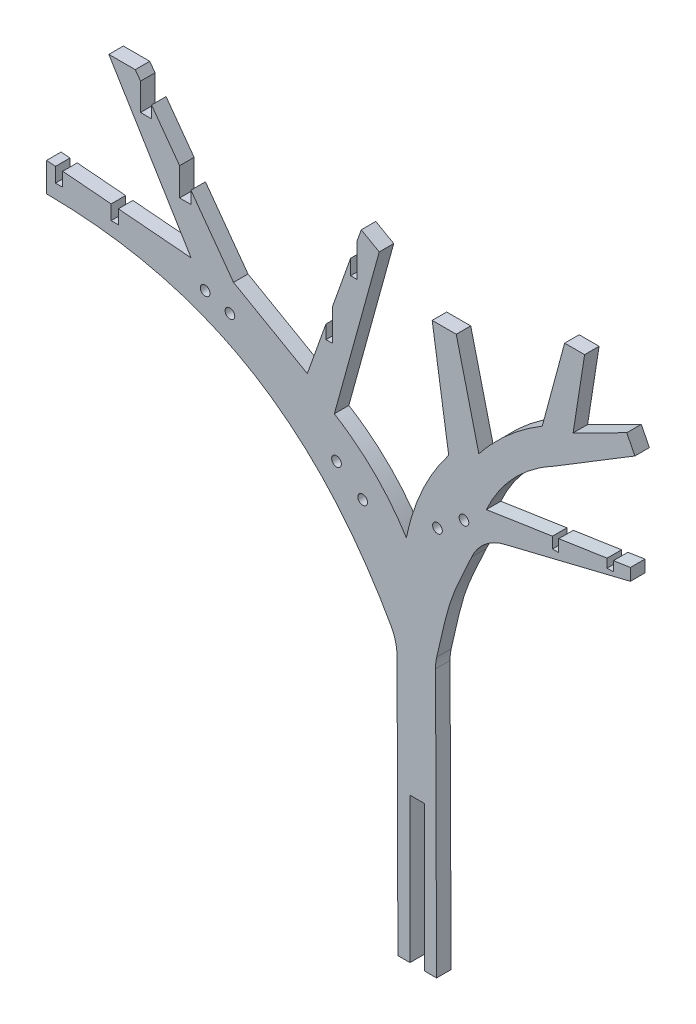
from build123d import *

# Parameters (mm, degrees)
BOSS_EXTRU_1_DEPTH      = 3
ESQUISSE2_R             = 1
ESQUISSE2_W             = 1.5
ESQUISSE2_H             = 3
ESQUISSE2_W_2           = 1.3
ESQUISSE2_H_2           = 2
ESQUISSE2_H_3           = 2.5
ESQUISSE2_H_4           = 6.790249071
ESQUISSE2_H_5           = 6.456046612
ESQUISSE2_W_3           = 2.272675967
ESQUISSE2_H_6           = 5.611187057
ESQUISSE2_W_4           = 2.338764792
ESQUISSE2_H_7           = 5.782769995
ENL_V_MAT_EXTRU_1_DEPTH = 3
ESQUISSE3_W             = 3
ESQUISSE3_H             = 30
ENL_V_MAT_EXTRU_2_DEPTH = 10


with BuildPart() as part:
    # Esquisse1 → Boss.-Extru.1 (new body)
    with BuildSketch(Plane.XY):
        with BuildLine():
            Line((2.351075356, 112.163345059), (2.17752481, 165.743470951))
            ThreePointArc((2.17752481, 165.743470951), (1.862948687, 168.187999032), (0.954541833, 170.479171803))
            add(Edge.make_bspline(
                [(0.954541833, 170.479171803), (-1.228394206, 174.454080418), (-17.892658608, 200.296518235), (-42.150144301, 212.093393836), (-70.300056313, 212.278545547)],
                knots=[0.022769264, 0.022769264, 0.022769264, 0.022769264, 0.195051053, 1, 1, 1, 1], degree=3))
            Line((-70.300056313, 212.278545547), (-70.300056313, 218.278545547))
            Line((-70.300056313, 218.278545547), (-40.416650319, 215.753973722))
            Line((-40.416650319, 215.753973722), (-57.432843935, 243.694191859))
            Line((-57.432843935, 243.694191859), (-51.970330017, 243.694191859))
            Line((-51.970330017, 243.694191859), (-31.645747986, 215.753973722))
            Line((-31.645747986, 215.753973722), (-16.377848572, 207.037706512))
            Line((-16.377848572, 207.037706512), (-5.21729031, 238.389396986))
            Line((-5.21729031, 238.389396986), (-1.510608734, 236.273911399))
            Line((-1.510608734, 236.273911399), (-10.79369782, 202.642361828))
            add(Edge.make_bspline(
                [(-10.79369782, 202.642361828), (-1.60539159, 197.009587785), (4.108630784, 187.873582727)],
                knots=[0, 0, 0, 1, 1, 1], degree=2))
            add(Edge.make_bspline(
                [(4.108630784, 187.873582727), (6.238182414, 198.495541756), (12.853772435, 207.037706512)],
                knots=[0, 0, 0, 1, 1, 1], degree=2))
            Line((12.853772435, 207.037706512), (9.439234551, 229.491603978))
            Line((9.439234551, 229.491603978), (14.412896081, 229.491603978))
            Line((14.412896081, 229.491603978), (19.091860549, 210.408407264))
            add(Edge.make_bspline(
                [(19.091860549, 210.408407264), (24.601810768, 217.389360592), (32.197853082, 221.927217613)],
                knots=[0, 0, 0, 1, 1, 1], degree=2))
            Line((32.197853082, 221.927217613), (36.832861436, 239.113723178))
            Line((36.832861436, 239.113723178), (40.962288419, 239.113723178))
            Line((40.962288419, 239.113723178), (38.586051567, 223.90477713))
            add(Edge.make_bspline(
                [(38.586051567, 223.90477713), (44.135550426, 226.698190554), (49.685049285, 229.491603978)],
                knots=[0, 0, 0, 1, 1, 1], degree=2))
            Line((49.685049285, 229.491603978), (51.362220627, 226.159673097))
            Line((51.362220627, 226.159673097), (34.561266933, 215.927531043))
            add(Edge.make_bspline(
                [(34.561266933, 215.927531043), (24.996176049, 210.756152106), (20.634328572, 201.197896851)],
                knots=[0, 0, 0, 1, 1, 1], degree=2))
            Line((20.634328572, 201.197896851), (50.431126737, 205.729061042))
            Line((50.431126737, 205.729061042), (50.431126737, 203.242114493))
            Line((50.431126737, 203.242114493), (24.364193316, 196.85082392))
            ThreePointArc((24.364193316, 196.85082392), (20.333256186, 194.812006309), (17.610759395, 191.207392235))
            add(Edge.make_bspline(
                [(17.610759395, 191.207392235), (16.095725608, 187.806098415), (13.315354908, 182.026541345), (12.360627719, 178.495380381), (10.374906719, 169.652516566)],
                knots=[0.094315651, 0.094315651, 0.094315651, 0.094315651, 0.397347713, 0.983634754, 0.983634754, 0.983634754, 0.983634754], degree=3))
            ThreePointArc((10.374906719, 169.652516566), (10.1906949, 168.544028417), (10.132009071, 167.42187159))
            Line((10.132009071, 167.42187159), (10.351075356, 112.163345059))
            Line((10.351075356, 112.163345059), (2.351075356, 112.163345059))
        make_face()
    extrude(amount=BOSS_EXTRU_1_DEPTH)

    # Esquisse2 → Enl_v. mat.-Extru.1 (cut)
    with BuildSketch(Plane.XY.offset(3)):
        with Locations((-37.516478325, 211.356141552)):
            Circle(ESQUISSE2_R)
        with Locations((-32.389949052, 209.813646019)):
            Circle(ESQUISSE2_R)
        with Locations((-10.352517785, 194.350574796)):
            Circle(ESQUISSE2_R)
        with Locations((-4.932356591, 190.198650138)):
            Circle(ESQUISSE2_R)
        with Locations((10.53493267, 192.842631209)):
            Circle(ESQUISSE2_R)
        with Locations((16.011958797, 197.009777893)):
            Circle(ESQUISSE2_R)
        with Locations((-67.712755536, 216.623329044)):
            Rectangle(ESQUISSE2_W, ESQUISSE2_H)
        with Locations((-56.212755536, 215.651800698)):
            Rectangle(ESQUISSE2_W, ESQUISSE2_H)
        with Locations((46.26336533, 204.194119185)):
            Rectangle(ESQUISSE2_W_2, ESQUISSE2_H_2)
        with Locations((34.96336533, 202.225741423)):
            Rectangle(ESQUISSE2_W_2, ESQUISSE2_H_3)
        with Locations((-6.772916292, 232.450232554)):
            Rectangle(ESQUISSE2_W_2, ESQUISSE2_H_4)
        with Locations((-11.873765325, 218.288279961)):
            Rectangle(ESQUISSE2_W_2, ESQUISSE2_H_5)
        with Locations((-49.733700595, 239.376026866)):
            Rectangle(ESQUISSE2_W_3, ESQUISSE2_H_6)
        with Locations((-41.62417837, 228.1874953)):
            Rectangle(ESQUISSE2_W_4, ESQUISSE2_H_7)
    extrude(amount=-ENL_V_MAT_EXTRU_1_DEPTH, mode=Mode.SUBTRACT)

    # Esquisse3 → Enl_v. mat.-Extru.2 (cut)
    with BuildSketch(Plane.XY.offset(3)):
        with Locations((6.351075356, 127.163345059)):
            Rectangle(ESQUISSE3_W, ESQUISSE3_H)
    extrude(amount=-ENL_V_MAT_EXTRU_2_DEPTH, mode=Mode.SUBTRACT)


solid = part.part
